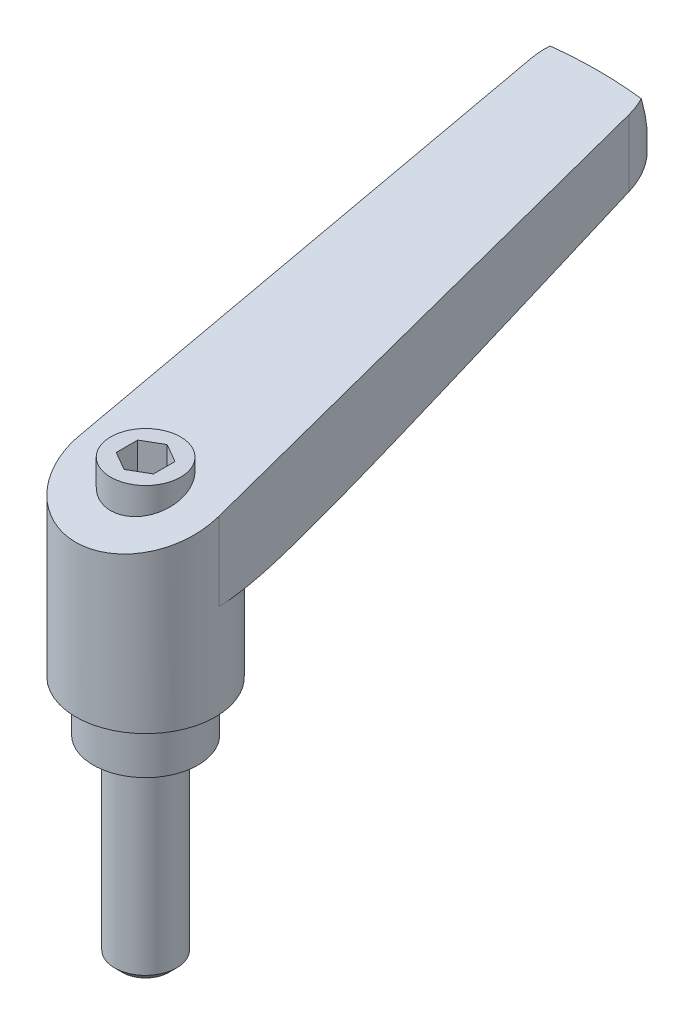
ISO-10303-21;
HEADER;
FILE_DESCRIPTION(('STEP AP214'),'2;1');
FILE_NAME('part.step','',(''),(''),'','','');
FILE_SCHEMA(('AUTOMOTIVE_DESIGN { 1 0 10303 214 1 1 1 1 }'));
ENDSEC;
DATA;
#1=APPLICATION_CONTEXT('core data for automotive mechanical design processes');
#2=APPLICATION_PROTOCOL_DEFINITION('international standard','automotive_design',2000,#1);
#3=PRODUCT_CONTEXT('',#1,'mechanical');
#4=PRODUCT('Part','Part','',(#3));
#5=PRODUCT_RELATED_PRODUCT_CATEGORY('part','',(#4));
#6=PRODUCT_DEFINITION_FORMATION('','',#4);
#7=PRODUCT_DEFINITION_CONTEXT('part definition',#1,'design');
#8=PRODUCT_DEFINITION('design','',#6,#7);
#9=PRODUCT_DEFINITION_SHAPE('','',#8);
#10=(LENGTH_UNIT() NAMED_UNIT(*) SI_UNIT(.MILLI.,.METRE.));
#11=(NAMED_UNIT(*) PLANE_ANGLE_UNIT() SI_UNIT($,.RADIAN.));
#12=(NAMED_UNIT(*) SI_UNIT($,.STERADIAN.) SOLID_ANGLE_UNIT());
#13=UNCERTAINTY_MEASURE_WITH_UNIT(LENGTH_MEASURE(1.E-05),#10,'distance_accuracy_value','');
#14=(GEOMETRIC_REPRESENTATION_CONTEXT(3) GLOBAL_UNCERTAINTY_ASSIGNED_CONTEXT((#13)) GLOBAL_UNIT_ASSIGNED_CONTEXT((#10,
#11,#12)) REPRESENTATION_CONTEXT('',''));
#15=CARTESIAN_POINT('',(0.,0.,0.));
#16=DIRECTION('',(0.,0.,1.));
#17=DIRECTION('',(1.,0.,0.));
#18=AXIS2_PLACEMENT_3D('',#15,#16,#17);
#19=CARTESIAN_POINT('',(0.,0.,0.));
#20=DIRECTION('',(0.,-1.,0.));
#21=DIRECTION('',(0.,0.,-1.));
#22=AXIS2_PLACEMENT_3D('',#19,#20,#21);
#23=PLANE('',#22);
#24=CARTESIAN_POINT('',(0.,0.,0.));
#25=DIRECTION('',(0.,-1.,0.));
#26=DIRECTION('',(0.,0.,-1.));
#27=AXIS2_PLACEMENT_3D('',#24,#25,#26);
#28=CIRCLE('',#27,6.75);
#29=CARTESIAN_POINT('',(0.,0.,-6.75));
#30=VERTEX_POINT('',#29);
#31=EDGE_CURVE('E305',#30,#30,#28,.T.);
#32=ORIENTED_EDGE('',*,*,#31,.T.);
#33=EDGE_LOOP('',(#32));
#34=FACE_BOUND('',#33,.T.);
#35=CARTESIAN_POINT('',(0.,0.,0.));
#36=DIRECTION('',(0.,-1.,0.));
#37=DIRECTION('',(0.,0.,-1.));
#38=AXIS2_PLACEMENT_3D('',#35,#36,#37);
#39=CIRCLE('',#38,4.);
#40=CARTESIAN_POINT('',(0.,0.,-4.));
#41=VERTEX_POINT('',#40);
#42=EDGE_CURVE('E299',#41,#41,#39,.T.);
#43=ORIENTED_EDGE('',*,*,#42,.F.);
#44=EDGE_LOOP('',(#43));
#45=FACE_BOUND('',#44,.T.);
#46=ADVANCED_FACE('F35',(#34,#45),#23,.T.);
#47=CARTESIAN_POINT('',(0.,6.5,0.));
#48=DIRECTION('',(0.,-1.,0.));
#49=DIRECTION('',(0.,0.,-1.));
#50=AXIS2_PLACEMENT_3D('',#47,#48,#49);
#51=PLANE('',#50);
#52=CARTESIAN_POINT('',(0.,6.5,0.));
#53=DIRECTION('',(0.,-1.,0.));
#54=DIRECTION('',(0.,0.,-1.));
#55=AXIS2_PLACEMENT_3D('',#52,#53,#54);
#56=CIRCLE('',#55,9.);
#57=CARTESIAN_POINT('',(0.,6.5,-9.));
#58=VERTEX_POINT('',#57);
#59=EDGE_CURVE('E129',#58,#58,#56,.T.);
#60=ORIENTED_EDGE('',*,*,#59,.T.);
#61=EDGE_LOOP('',(#60));
#62=FACE_BOUND('',#61,.T.);
#63=CARTESIAN_POINT('',(0.,6.5,0.));
#64=DIRECTION('',(0.,-1.,0.));
#65=DIRECTION('',(0.,0.,-1.));
#66=AXIS2_PLACEMENT_3D('',#63,#64,#65);
#67=CIRCLE('',#66,6.75);
#68=CARTESIAN_POINT('',(0.,6.5,-6.75));
#69=VERTEX_POINT('',#68);
#70=EDGE_CURVE('E304',#69,#69,#67,.T.);
#71=ORIENTED_EDGE('',*,*,#70,.F.);
#72=EDGE_LOOP('',(#71));
#73=FACE_BOUND('',#72,.T.);
#74=ADVANCED_FACE('F180',(#62,#73),#51,.T.);
#75=CARTESIAN_POINT('',(0.,12.5193093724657,0.));
#76=DIRECTION('',(0.,1.,0.));
#77=DIRECTION('',(0.,0.,1.));
#78=AXIS2_PLACEMENT_3D('',#75,#76,#77);
#79=CYLINDRICAL_SURFACE('',#78,9.);
#80=DIRECTION('',(0.,1.,0.));
#81=VECTOR('',#80,1.);
#82=CARTESIAN_POINT('',(-8.98942001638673,0.,-0.43626570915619));
#83=LINE('',#82,#81);
#84=CARTESIAN_POINT('',(-8.98942001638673,28.6530006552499,-0.436265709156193));
#85=VERTEX_POINT('',#84);
#86=CARTESIAN_POINT('',(-8.98942001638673,18.5386187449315,-0.436265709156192));
#87=VERTEX_POINT('',#86);
#88=EDGE_CURVE('E96',#85,#87,#83,.F.);
#89=ORIENTED_EDGE('',*,*,#88,.T.);
#90=CARTESIAN_POINT('',(0.,18.5386187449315,0.));
#91=DIRECTION('',(0.,1.,0.));
#92=DIRECTION('',(1.,0.,0.));
#93=AXIS2_PLACEMENT_3D('',#90,#91,#92);
#94=CIRCLE('',#93,9.);
#95=CARTESIAN_POINT('',(8.98942001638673,18.5386187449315,-0.436265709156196));
#96=VERTEX_POINT('',#95);
#97=EDGE_CURVE('E149',#96,#87,#94,.T.);
#98=ORIENTED_EDGE('',*,*,#97,.F.);
#99=DIRECTION('',(0.,1.,0.));
#100=VECTOR('',#99,1.);
#101=CARTESIAN_POINT('',(8.98942001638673,0.,-0.436265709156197));
#102=LINE('',#101,#100);
#103=CARTESIAN_POINT('',(8.98942001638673,28.6530006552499,-0.436265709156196));
#104=VERTEX_POINT('',#103);
#105=EDGE_CURVE('E98',#96,#104,#102,.T.);
#106=ORIENTED_EDGE('',*,*,#105,.T.);
#107=CARTESIAN_POINT('',(0.,28.529641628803,0.));
#108=DIRECTION('',(0.,-0.962270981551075,-0.272092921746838));
#109=DIRECTION('',(0.,0.272092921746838,-0.962270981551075));
#110=AXIS2_PLACEMENT_3D('',#107,#108,#109);
#111=ELLIPSE('',#110,9.35287478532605,9.);
#112=EDGE_CURVE('E91',#104,#85,#111,.T.);
#113=ORIENTED_EDGE('',*,*,#112,.T.);
#114=EDGE_LOOP('',(#89,#98,#106,#113));
#115=FACE_BOUND('',#114,.T.);
#116=ORIENTED_EDGE('',*,*,#59,.F.);
#117=EDGE_LOOP('',(#116));
#118=FACE_BOUND('',#117,.T.);
#119=ADVANCED_FACE('F93',(#115,#118),#79,.T.);
#120=CARTESIAN_POINT('',(0.,37.4621082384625,0.));
#121=DIRECTION('',(0.,1.,0.));
#122=DIRECTION('',(0.,0.,1.));
#123=AXIS2_PLACEMENT_3D('',#120,#121,#122);
#124=CONICAL_SURFACE('',#123,60.9918600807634,1.22173047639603);
#125=CARTESIAN_POINT('',(-6.29259401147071,35.7754430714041,-56.0053859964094));
#126=CARTESIAN_POINT('',(-6.28372206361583,35.841308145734,-56.1884783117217));
#127=CARTESIAN_POINT('',(-6.26682465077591,35.9067660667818,-56.3713355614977));
#128=CARTESIAN_POINT('',(-6.21705617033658,36.0364624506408,-56.7353336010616));
#129=CARTESIAN_POINT('',(-6.18418246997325,36.1007007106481,-56.9164741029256));
#130=CARTESIAN_POINT('',(-6.10244665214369,36.2276782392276,-57.2761492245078));
#131=CARTESIAN_POINT('',(-6.05354749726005,36.2904136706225,-57.4546767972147));
#132=CARTESIAN_POINT('',(-5.93997715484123,36.4138141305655,-57.8073649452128));
#133=CARTESIAN_POINT('',(-5.87530722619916,36.4744793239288,-57.9815258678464));
#134=CARTESIAN_POINT('',(-5.73034210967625,36.5934489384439,-58.3244810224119));
#135=CARTESIAN_POINT('',(-5.65001825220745,36.6517487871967,-58.4932647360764));
#136=CARTESIAN_POINT('',(-5.47422367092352,36.7654639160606,-58.8237650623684));
#137=CARTESIAN_POINT('',(-5.37875353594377,36.8208793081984,-58.9854819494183));
#138=CARTESIAN_POINT('',(-5.17340434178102,36.9283160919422,-59.3001526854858));
#139=CARTESIAN_POINT('',(-5.06355738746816,36.9803446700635,-59.4531249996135));
#140=CARTESIAN_POINT('',(-4.8300042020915,37.0807337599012,-59.7492745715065));
#141=CARTESIAN_POINT('',(-4.70630296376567,37.1290955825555,-59.8924553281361));
#142=CARTESIAN_POINT('',(-4.42575790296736,37.2289271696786,-60.1889211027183));
#143=CARTESIAN_POINT('',(-4.26674035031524,37.2797369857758,-60.3403906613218));
#144=CARTESIAN_POINT('',(-4.01629232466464,37.3515230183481,-60.5550503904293));
#145=CARTESIAN_POINT('',(-3.93079846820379,37.3747191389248,-60.6245296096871));
#146=CARTESIAN_POINT('',(-3.75602881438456,37.4195774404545,-60.7590912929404));
#147=CARTESIAN_POINT('',(-3.66675292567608,37.4412395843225,-60.8241736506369));
#148=CARTESIAN_POINT('',(-3.57567879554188,37.4621082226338,-60.8869568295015));
#149=B_SPLINE_CURVE_WITH_KNOTS('',3,(#125,#126,#127,#128,#129,#130,#131,#132,#133,#134,#135,
#136,#137,#138,#139,#140,#141,#142,#143,#144,#145,#146,#147,#148),.UNSPECIFIED.,.F.,.F.,(4,2,2,
2,2,2,2,2,2,2,2,4),(0.,0.584189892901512,1.1684760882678,1.75412230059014,2.3397217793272,
2.92640401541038,3.51306344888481,4.09843448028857,4.68359523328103,5.35845363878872,
5.69606178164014,6.03367808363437),.UNSPECIFIED.);
#150=CARTESIAN_POINT('',(-6.29259401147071,35.7754430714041,-56.0053859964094));
#151=VERTEX_POINT('',#150);
#152=CARTESIAN_POINT('',(-3.57567876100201,37.4621082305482,-60.8869568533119));
#153=VERTEX_POINT('',#152);
#154=EDGE_CURVE('E135',#151,#153,#149,.T.);
#155=ORIENTED_EDGE('',*,*,#154,.T.);
#156=CARTESIAN_POINT('',(0.,37.4621082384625,0.));
#157=DIRECTION('',(0.,-1.,0.));
#158=DIRECTION('',(1.,0.,0.));
#159=AXIS2_PLACEMENT_3D('',#156,#157,#158);
#160=CIRCLE('',#159,60.9918600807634);
#161=CARTESIAN_POINT('',(3.5756787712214,37.4621082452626,-60.886956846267));
#162=VERTEX_POINT('',#161);
#163=EDGE_CURVE('E145',#162,#153,#160,.F.);
#164=ORIENTED_EDGE('',*,*,#163,.F.);
#165=CARTESIAN_POINT('',(3.57567879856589,37.4621082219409,-60.8869568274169));
#166=CARTESIAN_POINT('',(3.72460383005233,37.4279924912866,-60.7843197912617));
#167=CARTESIAN_POINT('',(3.86873291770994,37.3917361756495,-60.6754786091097));
#168=CARTESIAN_POINT('',(4.14648448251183,37.3152416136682,-60.4464702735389));
#169=CARTESIAN_POINT('',(4.28011023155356,37.2750046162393,-60.3263066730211));
#170=CARTESIAN_POINT('',(4.53565871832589,37.1909498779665,-60.0760384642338));
#171=CARTESIAN_POINT('',(4.6576146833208,37.1471430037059,-59.9459640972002));
#172=CARTESIAN_POINT('',(4.88956351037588,37.0561480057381,-59.6766503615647));
#173=CARTESIAN_POINT('',(4.99955581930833,37.0089597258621,-59.5374105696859));
#174=CARTESIAN_POINT('',(5.20687320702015,36.9115618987,-59.2510132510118));
#175=CARTESIAN_POINT('',(5.3042099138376,36.8613551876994,-59.1038631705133));
#176=CARTESIAN_POINT('',(5.48588312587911,36.7581819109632,-58.8025868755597));
#177=CARTESIAN_POINT('',(5.57021432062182,36.7052142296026,-58.6484578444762));
#178=CARTESIAN_POINT('',(5.72544745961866,36.5968569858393,-58.3343752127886));
#179=CARTESIAN_POINT('',(5.79634820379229,36.5414672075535,-58.1744210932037));
#180=CARTESIAN_POINT('',(5.92442031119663,36.4286047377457,-57.8498178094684));
#181=CARTESIAN_POINT('',(5.98158890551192,36.3711316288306,-57.6851677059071));
#182=CARTESIAN_POINT('',(6.10621739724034,36.2262247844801,-57.2717880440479));
#183=CARTESIAN_POINT('',(6.16532229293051,36.1377215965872,-57.0208406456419));
#184=CARTESIAN_POINT('',(6.23056677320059,36.0030689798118,-56.6415427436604));
#185=CARTESIAN_POINT('',(6.24840828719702,35.9579021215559,-56.5147242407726));
#186=CARTESIAN_POINT('',(6.27632308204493,35.8670410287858,-56.2604499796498));
#187=CARTESIAN_POINT('',(6.28639783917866,35.8213468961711,-56.1329943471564));
#188=CARTESIAN_POINT('',(6.29259401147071,35.7754430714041,-56.0053859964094));
#189=B_SPLINE_CURVE_WITH_KNOTS('',3,(#165,#166,#167,#168,#169,#170,#171,#172,#173,#174,#175,
#176,#177,#178,#179,#180,#181,#182,#183,#184,#185,#186,#187,#188),.UNSPECIFIED.,.F.,.F.,(4,2,2,
2,2,2,2,2,2,2,2,4),(0.,0.551958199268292,1.10374377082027,1.65390833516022,2.20409832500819,
2.75377917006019,3.30368387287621,3.85363768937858,4.40370230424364,5.21931216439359,
5.6265231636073,6.03365674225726),.UNSPECIFIED.);
#190=CARTESIAN_POINT('',(6.29259401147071,35.7754430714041,-56.0053859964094));
#191=VERTEX_POINT('',#190);
#192=EDGE_CURVE('E144',#162,#191,#189,.T.);
#193=ORIENTED_EDGE('',*,*,#192,.T.);
#194=CARTESIAN_POINT('',(6.29259401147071,35.7754430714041,-56.0053859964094));
#195=CARTESIAN_POINT('',(6.34798180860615,35.3648994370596,-54.8640994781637));
#196=CARTESIAN_POINT('',(6.40337447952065,34.9546358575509,-53.7227125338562));
#197=CARTESIAN_POINT('',(6.51417165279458,34.1348013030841,-51.4396948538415));
#198=CARTESIAN_POINT('',(6.56957615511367,33.7252303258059,-50.2980641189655));
#199=CARTESIAN_POINT('',(6.73574949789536,32.4982057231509,-46.8739995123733));
#200=CARTESIAN_POINT('',(6.84653973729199,31.681983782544,-44.5911247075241));
#201=CARTESIAN_POINT('',(7.01269945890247,30.4621694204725,-41.1673407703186));
#202=CARTESIAN_POINT('',(7.06803575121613,30.0566530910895,-40.0271155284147));
#203=CARTESIAN_POINT('',(7.17873608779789,29.247274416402,-37.7460932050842));
#204=CARTESIAN_POINT('',(7.23410013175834,28.8434120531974,-36.6052961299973));
#205=CARTESIAN_POINT('',(7.34489428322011,28.0376184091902,-34.3223407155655));
#206=CARTESIAN_POINT('',(7.4003244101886,27.635688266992,-33.1801819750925));
#207=CARTESIAN_POINT('',(7.51123558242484,26.8346792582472,-30.8948153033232));
#208=CARTESIAN_POINT('',(7.56671662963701,26.4356005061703,-29.7516073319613));
#209=CARTESIAN_POINT('',(7.67793928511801,25.6399993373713,-27.4598224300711));
#210=CARTESIAN_POINT('',(7.73368112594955,25.2434907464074,-26.3112407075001));
#211=CARTESIAN_POINT('',(7.84525056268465,24.4561670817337,-24.0123102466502));
#212=CARTESIAN_POINT('',(7.90107814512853,24.0653511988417,-22.861961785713));
#213=CARTESIAN_POINT('',(7.98487911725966,23.4857617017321,-21.1352110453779));
#214=CARTESIAN_POINT('',(8.01280096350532,23.2938176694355,-20.5598708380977));
#215=CARTESIAN_POINT('',(8.06868696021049,22.9125706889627,-19.4083187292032));
#216=CARTESIAN_POINT('',(8.09665111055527,22.723267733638,-18.8321068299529));
#217=CARTESIAN_POINT('',(8.1526467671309,22.3478833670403,-17.6782951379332));
#218=CARTESIAN_POINT('',(8.18067830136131,22.1618037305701,-17.1006947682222));
#219=CARTESIAN_POINT('',(8.23680745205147,21.7939012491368,-15.9441323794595));
#220=CARTESIAN_POINT('',(8.26490506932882,21.6120784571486,-15.365170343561));
#221=CARTESIAN_POINT('',(8.32133365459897,21.2530199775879,-14.2024379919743));
#222=CARTESIAN_POINT('',(8.34966506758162,21.0758139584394,-13.6186585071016));
#223=CARTESIAN_POINT('',(8.40643403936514,20.7288390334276,-12.4489123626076));
#224=CARTESIAN_POINT('',(8.4348715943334,20.559069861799,-11.8629457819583));
#225=CARTESIAN_POINT('',(8.49183985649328,20.2298122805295,-10.6890931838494));
#226=CARTESIAN_POINT('',(8.52037035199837,20.0703083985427,-10.1012115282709));
#227=CARTESIAN_POINT('',(8.5776092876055,19.7649609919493,-8.92178160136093));
#228=CARTESIAN_POINT('',(8.60631775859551,19.6191199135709,-8.33023269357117));
#229=CARTESIAN_POINT('',(8.66413035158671,19.3454661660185,-7.13898233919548));
#230=CARTESIAN_POINT('',(8.6932358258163,19.2177723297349,-6.53925302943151));
#231=CARTESIAN_POINT('',(8.73706850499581,19.0460035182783,-5.63606408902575));
#232=CARTESIAN_POINT('',(8.75170486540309,18.9920533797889,-5.33447634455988));
#233=CARTESIAN_POINT('',(8.78103956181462,18.891783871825,-4.73002382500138));
#234=CARTESIAN_POINT('',(8.79573789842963,18.8454645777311,-4.42715903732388));
#235=CARTESIAN_POINT('',(8.82527290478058,18.7613046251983,-3.81857905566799));
#236=CARTESIAN_POINT('',(8.84010989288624,18.7235111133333,-3.51285730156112));
#237=CARTESIAN_POINT('',(8.86983456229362,18.6577804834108,-2.90036924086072));
#238=CARTESIAN_POINT('',(8.88472224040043,18.6298427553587,-2.59360300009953));
#239=CARTESIAN_POINT('',(8.91456612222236,18.5846720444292,-1.9786585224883));
#240=CARTESIAN_POINT('',(8.92952240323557,18.5674603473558,-1.67047869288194));
#241=CARTESIAN_POINT('',(8.95197356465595,18.5501873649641,-1.20786401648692));
#242=CARTESIAN_POINT('',(8.95946116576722,18.5458537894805,-1.05357916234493));
#243=CARTESIAN_POINT('',(8.97443912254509,18.5400676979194,-0.744952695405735));
#244=CARTESIAN_POINT('',(8.98192947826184,18.5386152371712,-0.590611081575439));
#245=CARTESIAN_POINT('',(8.98942001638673,18.5386187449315,-0.436265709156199));
#246=B_SPLINE_CURVE_WITH_KNOTS('',3,(#194,#195,#196,#197,#198,#199,#200,#201,#202,#203,#204,
#205,#206,#207,#208,#209,#210,#211,#212,#213,#214,#215,#216,#217,#218,#219,#220,#221,#222,#223,
#224,#225,#226,#227,#228,#229,#230,#231,#232,#233,#234,#235,#236,#237,#238,#239,#240,#241,#242,
#243,#244,#245),.UNSPECIFIED.,.F.,.F.,(4,2,2,2,2,2,2,2,2,2,2,2,2,2,2,2,2,2,2,2,2,2,2,2,2,4),(0.,
3.64243565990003,7.28485909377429,14.5656570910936,18.2000162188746,21.8343359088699,
25.4705843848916,29.106978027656,32.7560921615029,36.4046824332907,38.2261458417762,
40.0476043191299,41.8700357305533,43.6924898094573,45.5246725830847,47.3567898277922,
49.1860776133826,51.0156922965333,52.856784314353,53.7768791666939,54.6969831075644,
55.6220567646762,56.5470731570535,57.473919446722,57.9374775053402,58.4010444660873),.UNSPECIFIED.);
#247=EDGE_CURVE('E139',#191,#96,#246,.T.);
#248=ORIENTED_EDGE('',*,*,#247,.T.);
#249=ORIENTED_EDGE('',*,*,#97,.T.);
#250=CARTESIAN_POINT('',(-8.98942001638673,18.5386187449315,-0.43626570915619));
#251=CARTESIAN_POINT('',(-8.97985861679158,18.538606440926,-0.633281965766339));
#252=CARTESIAN_POINT('',(-8.9702973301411,18.5409786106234,-0.830295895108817));
#253=CARTESIAN_POINT('',(-8.95118062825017,18.5504014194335,-1.2242027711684));
#254=CARTESIAN_POINT('',(-8.94162521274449,18.5574518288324,-1.42109572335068));
#255=CARTESIAN_POINT('',(-8.92253050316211,18.5761352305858,-1.81454943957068));
#256=CARTESIAN_POINT('',(-8.91299120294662,18.587765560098,-2.01111033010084));
#257=CARTESIAN_POINT('',(-8.89392773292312,18.6154367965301,-2.40392034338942));
#258=CARTESIAN_POINT('',(-8.88440356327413,18.6314777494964,-2.6001694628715));
#259=CARTESIAN_POINT('',(-8.85593284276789,18.6857638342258,-3.18681943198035));
#260=CARTESIAN_POINT('',(-8.83701368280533,18.7302481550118,-3.57665588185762));
#261=CARTESIAN_POINT('',(-8.79926857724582,18.8338119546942,-4.35440806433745));
#262=CARTESIAN_POINT('',(-8.78044264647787,18.8928936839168,-4.74232349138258));
#263=CARTESIAN_POINT('',(-8.74298417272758,19.023054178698,-5.51416951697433));
#264=CARTESIAN_POINT('',(-8.72435113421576,19.0940728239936,-5.89811032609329));
#265=CARTESIAN_POINT('',(-8.68718364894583,19.2461944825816,-6.6639604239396));
#266=CARTESIAN_POINT('',(-8.66864919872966,19.3272971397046,-7.0458697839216));
#267=CARTESIAN_POINT('',(-8.63164797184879,19.4978472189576,-7.80829406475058));
#268=CARTESIAN_POINT('',(-8.61318130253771,19.5873044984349,-8.18880677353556));
#269=CARTESIAN_POINT('',(-8.58554157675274,19.7265349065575,-8.75833378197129));
#270=CARTESIAN_POINT('',(-8.57633837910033,19.7737858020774,-8.94796915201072));
#271=CARTESIAN_POINT('',(-8.55795065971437,19.8698091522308,-9.32685506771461));
#272=CARTESIAN_POINT('',(-8.54876613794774,19.9185816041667,-9.51610561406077));
#273=CARTESIAN_POINT('',(-8.52147216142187,20.0656944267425,-10.0785083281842));
#274=CARTESIAN_POINT('',(-8.50338782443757,20.1660200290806,-10.4511429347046));
#275=CARTESIAN_POINT('',(-8.46727730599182,20.37104043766,-11.1952138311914));
#276=CARTESIAN_POINT('',(-8.44925112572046,20.4757353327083,-11.5666500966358));
#277=CARTESIAN_POINT('',(-8.41324759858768,20.6887293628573,-12.3085163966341));
#278=CARTESIAN_POINT('',(-8.39527025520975,20.7970287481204,-12.6789463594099));
#279=CARTESIAN_POINT('',(-8.35935841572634,21.016613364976,-13.4189234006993));
#280=CARTESIAN_POINT('',(-8.34142391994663,21.1278986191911,-13.7884704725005));
#281=CARTESIAN_POINT('',(-8.28766562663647,21.465527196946,-14.896180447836));
#282=CARTESIAN_POINT('',(-8.25189666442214,21.6955856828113,-15.6332134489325));
#283=CARTESIAN_POINT('',(-8.18046838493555,22.1627037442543,-17.1050201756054));
#284=CARTESIAN_POINT('',(-8.14480906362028,22.3997630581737,-17.8397939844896));
#285=CARTESIAN_POINT('',(-8.07356395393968,22.8790726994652,-19.3078264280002));
#286=CARTESIAN_POINT('',(-8.03797818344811,23.1213241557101,-20.0410846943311));
#287=CARTESIAN_POINT('',(-7.96686859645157,23.6096790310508,-21.5063246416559));
#288=CARTESIAN_POINT('',(-7.93134478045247,23.8557824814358,-22.2383063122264));
#289=CARTESIAN_POINT('',(-7.86035135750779,24.3508973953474,-23.7011526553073));
#290=CARTESIAN_POINT('',(-7.82488174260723,24.5999083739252,-24.4320174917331));
#291=CARTESIAN_POINT('',(-7.75398075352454,25.1002377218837,-25.8929592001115));
#292=CARTESIAN_POINT('',(-7.71854937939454,25.3515560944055,-26.6230360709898));
#293=CARTESIAN_POINT('',(-7.61185777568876,26.1113869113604,-28.8214569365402));
#294=CARTESIAN_POINT('',(-7.54064384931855,26.6226654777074,-30.2888468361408));
#295=CARTESIAN_POINT('',(-7.39829463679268,27.6500397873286,-33.2220062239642));
#296=CARTESIAN_POINT('',(-7.32715935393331,28.1661357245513,-34.6877756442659));
#297=CARTESIAN_POINT('',(-7.18496317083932,29.2015363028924,-37.6177818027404));
#298=CARTESIAN_POINT('',(-7.11390225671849,29.7208401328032,-39.082018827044));
#299=CARTESIAN_POINT('',(-6.97182234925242,30.7618348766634,-42.0096290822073));
#300=CARTESIAN_POINT('',(-6.90080335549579,31.2835257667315,-43.4730023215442));
#301=CARTESIAN_POINT('',(-6.78494036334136,32.136268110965,-45.8604031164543));
#302=CARTESIAN_POINT('',(-6.74008711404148,32.466784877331,-46.7846212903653));
#303=CARTESIAN_POINT('',(-6.65038901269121,33.1284323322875,-48.6328846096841));
#304=CARTESIAN_POINT('',(-6.60554416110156,33.4595630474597,-49.5569297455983));
#305=CARTESIAN_POINT('',(-6.51600982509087,34.1212474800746,-51.4018186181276));
#306=CARTESIAN_POINT('',(-6.47132031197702,34.4517995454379,-52.322662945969));
#307=CARTESIAN_POINT('',(-6.38195081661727,35.1133216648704,-54.1641552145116));
#308=CARTESIAN_POINT('',(-6.33727083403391,35.4442916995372,-55.0848031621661));
#309=CARTESIAN_POINT('',(-6.29259401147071,35.7754430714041,-56.0053859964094));
#310=B_SPLINE_CURVE_WITH_KNOTS('',3,(#250,#251,#252,#253,#254,#255,#256,#257,#258,#259,#260,
#261,#262,#263,#264,#265,#266,#267,#268,#269,#270,#271,#272,#273,#274,#275,#276,#277,#278,#279,
#280,#281,#282,#283,#284,#285,#286,#287,#288,#289,#290,#291,#292,#293,#294,#295,#296,#297,#298,
#299,#300,#301,#302,#303,#304,#305,#306,#307,#308,#309),.UNSPECIFIED.,.F.,.F.,(4,2,2,2,2,2,2,2,
2,2,2,2,2,2,2,2,2,2,2,2,2,2,2,2,2,2,2,2,2,4),(0.,0.591726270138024,1.18342348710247,
1.77477718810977,2.36613706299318,3.54425078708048,4.72254624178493,5.89507589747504,
7.06756415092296,8.24145369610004,8.82839873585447,9.4153427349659,10.5742886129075,
11.7332580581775,12.892308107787,14.0513669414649,16.3701058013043,18.6887581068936,
21.007919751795,23.3271002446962,25.6458992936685,27.9647014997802,32.6313119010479,
37.2981109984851,41.9637746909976,46.6293918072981,49.5770841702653,52.524907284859,
55.4630945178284,58.4011500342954),.UNSPECIFIED.);
#311=EDGE_CURVE('E112',#87,#151,#310,.T.);
#312=ORIENTED_EDGE('',*,*,#311,.T.);
#313=EDGE_LOOP('',(#155,#164,#193,#248,#249,#312));
#314=FACE_BOUND('',#313,.T.);
#315=ADVANCED_FACE('F315',(#314),#124,.T.);
#316=CARTESIAN_POINT('',(0.,35.7205521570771,-55.7));
#317=DIRECTION('',(0.,1.,0.));
#318=DIRECTION('',(0.,0.,1.));
#319=AXIS2_PLACEMENT_3D('',#316,#317,#318);
#320=CYLINDRICAL_SURFACE('',#319,6.3);
#321=DIRECTION('',(0.,1.,0.));
#322=VECTOR('',#321,1.);
#323=CARTESIAN_POINT('',(6.29259401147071,0.,-56.0053859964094));
#324=LINE('',#323,#322);
#325=CARTESIAN_POINT('',(6.29259401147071,44.3657931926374,-56.0053859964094));
#326=VERTEX_POINT('',#325);
#327=EDGE_CURVE('E140',#326,#191,#324,.F.);
#328=ORIENTED_EDGE('',*,*,#327,.T.);
#329=ORIENTED_EDGE('',*,*,#192,.F.);
#330=CARTESIAN_POINT('',(5.87324142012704,44.9239287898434,-57.9792620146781));
#331=CARTESIAN_POINT('',(5.82535509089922,44.6001356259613,-58.1025627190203));
#332=CARTESIAN_POINT('',(5.7730240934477,44.2770144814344,-58.225982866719));
#333=CARTESIAN_POINT('',(5.65859186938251,43.6325054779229,-58.4728997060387));
#334=CARTESIAN_POINT('',(5.59648972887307,43.311117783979,-58.5963964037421));
#335=CARTESIAN_POINT('',(5.46211230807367,42.6727553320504,-58.8424215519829));
#336=CARTESIAN_POINT('',(5.38991085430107,42.3557654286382,-58.9649507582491));
#337=CARTESIAN_POINT('',(5.23386884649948,41.7245298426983,-59.2096566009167));
#338=CARTESIAN_POINT('',(5.15002898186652,41.4102839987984,-59.3318332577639));
#339=CARTESIAN_POINT('',(4.96912232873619,40.7848764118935,-59.5756814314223));
#340=CARTESIAN_POINT('',(4.87203770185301,40.4737194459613,-59.6973520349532));
#341=CARTESIAN_POINT('',(4.66283934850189,39.8561270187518,-59.9395235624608));
#342=CARTESIAN_POINT('',(4.55073180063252,39.5496896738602,-60.0600249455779));
#343=CARTESIAN_POINT('',(4.36890604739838,39.0937105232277,-60.2398201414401));
#344=CARTESIAN_POINT('',(4.30577334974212,38.9418019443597,-60.2998018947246));
#345=CARTESIAN_POINT('',(4.1745988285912,38.6398951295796,-60.419172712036));
#346=CARTESIAN_POINT('',(4.10655749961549,38.4898967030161,-60.4785618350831));
#347=CARTESIAN_POINT('',(3.96497409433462,38.1919547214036,-60.5966837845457));
#348=CARTESIAN_POINT('',(3.8914245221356,38.0440143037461,-60.6554155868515));
#349=CARTESIAN_POINT('',(3.73825635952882,37.7508674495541,-60.7719454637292));
#350=CARTESIAN_POINT('',(3.65863569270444,37.6056619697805,-60.8297432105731));
#351=CARTESIAN_POINT('',(3.5756787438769,37.4621082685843,-60.8869568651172));
#352=B_SPLINE_CURVE_WITH_KNOTS('',3,(#330,#331,#332,#333,#334,#335,#336,#337,#338,#339,#340,
#341,#342,#343,#344,#345,#346,#347,#348,#349,#350,#351),.UNSPECIFIED.,.F.,.F.,(4,2,2,2,2,2,2,2,
2,2,4),(0.,1.04931969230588,2.09873758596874,3.14085028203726,4.18290127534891,5.2263698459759,
6.26941057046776,6.79464312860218,7.31982284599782,7.84573071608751,8.3718192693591),.UNSPECIFIED.);
#353=CARTESIAN_POINT('',(5.87324141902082,44.9239287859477,-57.9792619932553));
#354=VERTEX_POINT('',#353);
#355=EDGE_CURVE('E148',#354,#162,#352,.T.);
#356=ORIENTED_EDGE('',*,*,#355,.F.);
#357=CARTESIAN_POINT('',(0.,44.2794418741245,-55.7));
#358=DIRECTION('',(0.,-0.962270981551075,-0.272092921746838));
#359=DIRECTION('',(0.,0.272092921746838,-0.962270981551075));
#360=AXIS2_PLACEMENT_3D('',#357,#358,#359);
#361=ELLIPSE('',#360,6.54701234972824,6.3);
#362=EDGE_CURVE('E133',#354,#326,#361,.T.);
#363=ORIENTED_EDGE('',*,*,#362,.T.);
#364=EDGE_LOOP('',(#328,#329,#356,#363));
#365=FACE_BOUND('',#364,.T.);
#366=ADVANCED_FACE('F320',(#365),#320,.T.);
#367=CARTESIAN_POINT('',(8.98942001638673,0.,-0.436265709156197));
#368=DIRECTION('',(-0.998824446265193,0.,0.0484739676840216));
#369=DIRECTION('',(0.0484739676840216,0.,0.998824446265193));
#370=AXIS2_PLACEMENT_3D('',#367,#368,#369);
#371=PLANE('',#370);
#372=ORIENTED_EDGE('',*,*,#105,.F.);
#373=ORIENTED_EDGE('',*,*,#247,.F.);
#374=ORIENTED_EDGE('',*,*,#327,.F.);
#375=DIRECTION('',(0.046649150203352,-0.271796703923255,0.961223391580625));
#376=VECTOR('',#375,1.);
#377=CARTESIAN_POINT('',(6.29259401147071,44.3657931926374,-56.0053859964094));
#378=LINE('',#377,#376);
#379=EDGE_CURVE('E105',#326,#104,#378,.T.);
#380=ORIENTED_EDGE('',*,*,#379,.T.);
#381=EDGE_LOOP('',(#372,#373,#374,#380));
#382=FACE_BOUND('',#381,.T.);
#383=ADVANCED_FACE('F324',(#382),#371,.F.);
#384=CARTESIAN_POINT('',(-6.29259401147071,0.,-56.0053859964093));
#385=DIRECTION('',(0.998824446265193,0.,0.0484739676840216));
#386=DIRECTION('',(0.0484739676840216,0.,-0.998824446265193));
#387=AXIS2_PLACEMENT_3D('',#384,#385,#386);
#388=PLANE('',#387);
#389=DIRECTION('',(0.,1.,0.));
#390=VECTOR('',#389,1.);
#391=CARTESIAN_POINT('',(-6.29259401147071,0.,-56.0053859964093));
#392=LINE('',#391,#390);
#393=CARTESIAN_POINT('',(-6.29259401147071,44.3657931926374,-56.0053859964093));
#394=VERTEX_POINT('',#393);
#395=EDGE_CURVE('E134',#394,#151,#392,.F.);
#396=ORIENTED_EDGE('',*,*,#395,.T.);
#397=ORIENTED_EDGE('',*,*,#311,.F.);
#398=ORIENTED_EDGE('',*,*,#88,.F.);
#399=DIRECTION('',(0.0466491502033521,0.271796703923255,-0.961223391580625));
#400=VECTOR('',#399,1.);
#401=CARTESIAN_POINT('',(-8.98942001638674,28.6530006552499,-0.436265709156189));
#402=LINE('',#401,#400);
#403=EDGE_CURVE('E104',#85,#394,#402,.T.);
#404=ORIENTED_EDGE('',*,*,#403,.T.);
#405=EDGE_LOOP('',(#396,#397,#398,#404));
#406=FACE_BOUND('',#405,.T.);
#407=ADVANCED_FACE('F111',(#406),#388,.F.);
#408=CARTESIAN_POINT('',(0.,35.7205521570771,-55.7));
#409=DIRECTION('',(0.,1.,0.));
#410=DIRECTION('',(0.,0.,1.));
#411=AXIS2_PLACEMENT_3D('',#408,#409,#410);
#412=CYLINDRICAL_SURFACE('',#411,6.3);
#413=CARTESIAN_POINT('',(-3.57567874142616,37.4621082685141,-60.8869568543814));
#414=CARTESIAN_POINT('',(-3.63175980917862,37.5591226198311,-60.8482917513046));
#415=CARTESIAN_POINT('',(-3.68630366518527,37.6569028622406,-60.8093551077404));
#416=CARTESIAN_POINT('',(-3.79252427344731,37.8538071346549,-60.7310163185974));
#417=CARTESIAN_POINT('',(-3.84420141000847,37.9529309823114,-60.6916142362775));
#418=CARTESIAN_POINT('',(-3.99519672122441,38.2519391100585,-60.5728646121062));
#419=CARTESIAN_POINT('',(-4.09055488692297,38.4535931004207,-60.4929206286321));
#420=CARTESIAN_POINT('',(-4.2718386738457,38.8600913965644,-60.3320660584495));
#421=CARTESIAN_POINT('',(-4.3577842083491,39.0649278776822,-60.2511579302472));
#422=CARTESIAN_POINT('',(-4.52155508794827,39.4775278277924,-60.0884915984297));
#423=CARTESIAN_POINT('',(-4.59937889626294,39.6852918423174,-60.0067332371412));
#424=CARTESIAN_POINT('',(-4.74711642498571,40.1014063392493,-59.8432978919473));
#425=CARTESIAN_POINT('',(-4.8170910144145,40.3097372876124,-59.7616259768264));
#426=CARTESIAN_POINT('',(-4.95054747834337,40.7283056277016,-59.5978487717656));
#427=CARTESIAN_POINT('',(-5.01402887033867,40.9385431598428,-59.5157434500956));
#428=CARTESIAN_POINT('',(-5.19564518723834,41.5718103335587,-59.2689090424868));
#429=CARTESIAN_POINT('',(-5.30489735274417,41.9972368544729,-59.103723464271));
#430=CARTESIAN_POINT('',(-5.45176075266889,42.6309877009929,-58.8586222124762));
#431=CARTESIAN_POINT('',(-5.49716856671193,42.837627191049,-58.7788567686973));
#432=CARTESIAN_POINT('',(-5.58353901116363,43.2517599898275,-58.6193029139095));
#433=CARTESIAN_POINT('',(-5.62450293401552,43.4592530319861,-58.5395145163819));
#434=CARTESIAN_POINT('',(-5.70241573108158,43.8758546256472,-58.379626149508));
#435=CARTESIAN_POINT('',(-5.73934778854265,44.0849663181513,-58.2995262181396));
#436=CARTESIAN_POINT('',(-5.80923067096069,44.5039304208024,-58.1393561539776));
#437=CARTESIAN_POINT('',(-5.84218044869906,44.7137830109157,-58.0592860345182));
#438=CARTESIAN_POINT('',(-5.87324141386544,44.923928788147,-57.9792620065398));
#439=B_SPLINE_CURVE_WITH_KNOTS('',3,(#413,#414,#415,#416,#417,#418,#419,#420,#421,#422,#423,
#424,#425,#426,#427,#428,#429,#430,#431,#432,#433,#434,#435,#436,#437,#438),.UNSPECIFIED.,.F.,
.F.,(4,2,2,2,2,2,2,2,2,2,2,2,4),(0.,0.355589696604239,0.711131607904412,1.4217292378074,
2.13079324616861,2.83999118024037,3.54324092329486,4.24654288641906,5.65368043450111,
6.33197341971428,7.01006860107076,7.69089195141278,8.37189394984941),.UNSPECIFIED.);
#440=CARTESIAN_POINT('',(-5.87324141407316,44.9239287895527,-57.9792620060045));
#441=VERTEX_POINT('',#440);
#442=EDGE_CURVE('E59',#153,#441,#439,.T.);
#443=ORIENTED_EDGE('',*,*,#442,.F.);
#444=ORIENTED_EDGE('',*,*,#154,.F.);
#445=ORIENTED_EDGE('',*,*,#395,.F.);
#446=CARTESIAN_POINT('',(0.,44.2794418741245,-55.7));
#447=DIRECTION('',(0.,-0.962270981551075,-0.272092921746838));
#448=DIRECTION('',(0.,0.272092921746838,-0.962270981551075));
#449=AXIS2_PLACEMENT_3D('',#446,#447,#448);
#450=ELLIPSE('',#449,6.54701234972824,6.3);
#451=EDGE_CURVE('E118',#394,#441,#450,.T.);
#452=ORIENTED_EDGE('',*,*,#451,.T.);
#453=EDGE_LOOP('',(#443,#444,#445,#452));
#454=FACE_BOUND('',#453,.T.);
#455=ADVANCED_FACE('F168',(#454),#412,.T.);
#456=CARTESIAN_POINT('',(0.,37.4621082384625,0.));
#457=DIRECTION('',(0.,-1.,0.));
#458=DIRECTION('',(0.,0.,-1.));
#459=AXIS2_PLACEMENT_3D('',#456,#457,#458);
#460=CONICAL_SURFACE('',#459,60.9918600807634,0.349065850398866);
#461=ORIENTED_EDGE('',*,*,#163,.T.);
#462=ORIENTED_EDGE('',*,*,#442,.T.);
#463=CARTESIAN_POINT('',(0.,26.6401020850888,6.6824563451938));
#464=DIRECTION('',(0.,-0.962270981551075,-0.272092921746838));
#465=DIRECTION('',(0.,-0.272092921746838,0.962270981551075));
#466=AXIS2_PLACEMENT_3D('',#463,#464,#465);
#467=ELLIPSE('',#466,67.4765730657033,64.5859647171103);
#468=EDGE_CURVE('E125',#441,#354,#467,.T.);
#469=ORIENTED_EDGE('',*,*,#468,.T.);
#470=ORIENTED_EDGE('',*,*,#355,.T.);
#471=EDGE_LOOP('',(#461,#462,#469,#470));
#472=FACE_BOUND('',#471,.T.);
#473=ADVANCED_FACE('F171',(#472),#460,.T.);
#474=CARTESIAN_POINT('',(18.,25.9847906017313,9.));
#475=DIRECTION('',(0.,-0.962270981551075,-0.272092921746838));
#476=DIRECTION('',(0.,0.272092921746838,-0.962270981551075));
#477=AXIS2_PLACEMENT_3D('',#474,#475,#476);
#478=PLANE('',#477);
#479=CARTESIAN_POINT('',(0.,28.5296416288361,0.));
#480=DIRECTION('',(0.,-0.962270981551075,-0.272092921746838));
#481=DIRECTION('',(0.,0.272092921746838,-0.962270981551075));
#482=AXIS2_PLACEMENT_3D('',#479,#480,#481);
#483=ELLIPSE('',#482,4.67643739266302,4.5);
#484=CARTESIAN_POINT('',(0.,29.8020671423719,-4.5));
#485=VERTEX_POINT('',#484);
#486=EDGE_CURVE('E282',#485,#485,#483,.F.);
#487=ORIENTED_EDGE('',*,*,#486,.F.);
#488=EDGE_LOOP('',(#487));
#489=FACE_BOUND('',#488,.T.);
#490=ORIENTED_EDGE('',*,*,#451,.F.);
#491=ORIENTED_EDGE('',*,*,#403,.F.);
#492=ORIENTED_EDGE('',*,*,#112,.F.);
#493=ORIENTED_EDGE('',*,*,#379,.F.);
#494=ORIENTED_EDGE('',*,*,#362,.F.);
#495=ORIENTED_EDGE('',*,*,#468,.F.);
#496=EDGE_LOOP('',(#490,#491,#492,#493,#494,#495));
#497=FACE_BOUND('',#496,.T.);
#498=ADVANCED_FACE('F116',(#489,#497),#478,.F.);
#499=CARTESIAN_POINT('',(0.,0.,0.));
#500=DIRECTION('',(0.,1.,0.));
#501=DIRECTION('',(0.,0.,1.));
#502=AXIS2_PLACEMENT_3D('',#499,#500,#501);
#503=CYLINDRICAL_SURFACE('',#502,6.75);
#504=ORIENTED_EDGE('',*,*,#31,.F.);
#505=EDGE_LOOP('',(#504));
#506=FACE_BOUND('',#505,.T.);
#507=ORIENTED_EDGE('',*,*,#70,.T.);
#508=EDGE_LOOP('',(#507));
#509=FACE_BOUND('',#508,.T.);
#510=ADVANCED_FACE('F178',(#506,#509),#503,.T.);
#511=CARTESIAN_POINT('',(0.,-25.,0.));
#512=DIRECTION('',(0.,1.,0.));
#513=DIRECTION('',(0.,0.,1.));
#514=AXIS2_PLACEMENT_3D('',#511,#512,#513);
#515=CYLINDRICAL_SURFACE('',#514,4.);
#516=CARTESIAN_POINT('',(0.,-23.9999999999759,0.));
#517=DIRECTION('',(0.,-1.,0.));
#518=DIRECTION('',(0.,0.,-1.));
#519=AXIS2_PLACEMENT_3D('',#516,#517,#518);
#520=CIRCLE('',#519,4.);
#521=CARTESIAN_POINT('',(0.,-23.9999999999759,-4.));
#522=VERTEX_POINT('',#521);
#523=EDGE_CURVE('E12',#522,#522,#520,.F.);
#524=ORIENTED_EDGE('',*,*,#523,.T.);
#525=EDGE_LOOP('',(#524));
#526=FACE_BOUND('',#525,.T.);
#527=ORIENTED_EDGE('',*,*,#42,.T.);
#528=EDGE_LOOP('',(#527));
#529=FACE_BOUND('',#528,.T.);
#530=ADVANCED_FACE('F186',(#526,#529),#515,.T.);
#531=CARTESIAN_POINT('',(0.,-25.,0.));
#532=DIRECTION('',(0.,-1.,0.));
#533=DIRECTION('',(0.,0.,-1.));
#534=AXIS2_PLACEMENT_3D('',#531,#532,#533);
#535=PLANE('',#534);
#536=CARTESIAN_POINT('',(0.,-25.,0.));
#537=DIRECTION('',(0.,-1.,0.));
#538=DIRECTION('',(0.,0.,-1.));
#539=AXIS2_PLACEMENT_3D('',#536,#537,#538);
#540=CIRCLE('',#539,3.00000000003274);
#541=CARTESIAN_POINT('',(0.,-25.,-3.00000000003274));
#542=VERTEX_POINT('',#541);
#543=EDGE_CURVE('E43',#542,#542,#540,.T.);
#544=ORIENTED_EDGE('',*,*,#543,.T.);
#545=EDGE_LOOP('',(#544));
#546=FACE_BOUND('',#545,.T.);
#547=ADVANCED_FACE('F193',(#546),#535,.T.);
#548=CARTESIAN_POINT('',(0.,-500000.,0.));
#549=DIRECTION('',(0.,1.,0.));
#550=DIRECTION('',(0.,0.,1.));
#551=AXIS2_PLACEMENT_3D('',#548,#549,#550);
#552=CYLINDRICAL_SURFACE('',#551,4.5);
#553=CARTESIAN_POINT('',(0.,31.,0.));
#554=DIRECTION('',(0.,1.,0.));
#555=DIRECTION('',(0.,0.,-1.));
#556=AXIS2_PLACEMENT_3D('',#553,#554,#555);
#557=CIRCLE('',#556,4.5);
#558=CARTESIAN_POINT('',(0.,31.,-4.5));
#559=VERTEX_POINT('',#558);
#560=EDGE_CURVE('E296',#559,#559,#557,.T.);
#561=ORIENTED_EDGE('',*,*,#560,.F.);
#562=EDGE_LOOP('',(#561));
#563=FACE_BOUND('',#562,.T.);
#564=ORIENTED_EDGE('',*,*,#486,.T.);
#565=EDGE_LOOP('',(#564));
#566=FACE_BOUND('',#565,.T.);
#567=ADVANCED_FACE('F197',(#563,#566),#552,.T.);
#568=CARTESIAN_POINT('',(0.,31.,0.));
#569=DIRECTION('',(0.,-1.,0.));
#570=DIRECTION('',(0.,0.,-1.));
#571=AXIS2_PLACEMENT_3D('',#568,#569,#570);
#572=PLANE('',#571);
#573=DIRECTION('',(-0.866025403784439,0.,-0.5));
#574=VECTOR('',#573,1.);
#575=CARTESIAN_POINT('',(2.4,31.,-1.3856406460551));
#576=LINE('',#575,#574);
#577=CARTESIAN_POINT('',(2.4,31.,-1.3856406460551));
#578=VERTEX_POINT('',#577);
#579=CARTESIAN_POINT('',(0.,31.,-2.7712812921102));
#580=VERTEX_POINT('',#579);
#581=EDGE_CURVE('E269',#578,#580,#576,.T.);
#582=ORIENTED_EDGE('',*,*,#581,.F.);
#583=DIRECTION('',(0.,0.,-1.));
#584=VECTOR('',#583,1.);
#585=CARTESIAN_POINT('',(2.4,31.,1.3856406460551));
#586=LINE('',#585,#584);
#587=CARTESIAN_POINT('',(2.4,31.,1.3856406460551));
#588=VERTEX_POINT('',#587);
#589=EDGE_CURVE('E50',#588,#578,#586,.T.);
#590=ORIENTED_EDGE('',*,*,#589,.F.);
#591=DIRECTION('',(0.866025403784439,0.,-0.5));
#592=VECTOR('',#591,1.);
#593=CARTESIAN_POINT('',(0.,31.,2.7712812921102));
#594=LINE('',#593,#592);
#595=CARTESIAN_POINT('',(0.,31.,2.7712812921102));
#596=VERTEX_POINT('',#595);
#597=EDGE_CURVE('E252',#596,#588,#594,.T.);
#598=ORIENTED_EDGE('',*,*,#597,.F.);
#599=DIRECTION('',(0.866025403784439,0.,0.5));
#600=VECTOR('',#599,1.);
#601=CARTESIAN_POINT('',(-2.4,31.,1.3856406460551));
#602=LINE('',#601,#600);
#603=CARTESIAN_POINT('',(-2.4,31.,1.3856406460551));
#604=VERTEX_POINT('',#603);
#605=EDGE_CURVE('E257',#604,#596,#602,.T.);
#606=ORIENTED_EDGE('',*,*,#605,.F.);
#607=DIRECTION('',(0.,0.,1.));
#608=VECTOR('',#607,1.);
#609=CARTESIAN_POINT('',(-2.4,31.,-1.3856406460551));
#610=LINE('',#609,#608);
#611=CARTESIAN_POINT('',(-2.4,31.,-1.3856406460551));
#612=VERTEX_POINT('',#611);
#613=EDGE_CURVE('E275',#612,#604,#610,.T.);
#614=ORIENTED_EDGE('',*,*,#613,.F.);
#615=DIRECTION('',(-0.866025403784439,0.,0.5));
#616=VECTOR('',#615,1.);
#617=CARTESIAN_POINT('',(0.,31.,-2.7712812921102));
#618=LINE('',#617,#616);
#619=EDGE_CURVE('E272',#580,#612,#618,.T.);
#620=ORIENTED_EDGE('',*,*,#619,.F.);
#621=EDGE_LOOP('',(#582,#590,#598,#606,#614,#620));
#622=FACE_BOUND('',#621,.T.);
#623=ORIENTED_EDGE('',*,*,#560,.T.);
#624=EDGE_LOOP('',(#623));
#625=FACE_BOUND('',#624,.T.);
#626=ADVANCED_FACE('F199',(#622,#625),#572,.F.);
#627=CARTESIAN_POINT('',(2.4,26.2,1.3856406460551));
#628=DIRECTION('',(1.,0.,0.));
#629=DIRECTION('',(0.,0.,-1.));
#630=AXIS2_PLACEMENT_3D('',#627,#628,#629);
#631=PLANE('',#630);
#632=ORIENTED_EDGE('',*,*,#589,.T.);
#633=DIRECTION('',(0.,1.,0.));
#634=VECTOR('',#633,1.);
#635=CARTESIAN_POINT('',(2.4,26.2,-1.3856406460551));
#636=LINE('',#635,#634);
#637=CARTESIAN_POINT('',(2.4,26.2,-1.3856406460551));
#638=VERTEX_POINT('',#637);
#639=EDGE_CURVE('E267',#638,#578,#636,.T.);
#640=ORIENTED_EDGE('',*,*,#639,.F.);
#641=DIRECTION('',(0.,0.,-1.));
#642=VECTOR('',#641,1.);
#643=CARTESIAN_POINT('',(2.4,26.2,1.3856406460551));
#644=LINE('',#643,#642);
#645=CARTESIAN_POINT('',(2.4,26.2,1.3856406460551));
#646=VERTEX_POINT('',#645);
#647=EDGE_CURVE('E241',#646,#638,#644,.T.);
#648=ORIENTED_EDGE('',*,*,#647,.F.);
#649=DIRECTION('',(0.,1.,0.));
#650=VECTOR('',#649,1.);
#651=CARTESIAN_POINT('',(2.4,26.2,1.3856406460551));
#652=LINE('',#651,#650);
#653=EDGE_CURVE('E280',#646,#588,#652,.T.);
#654=ORIENTED_EDGE('',*,*,#653,.T.);
#655=EDGE_LOOP('',(#632,#640,#648,#654));
#656=FACE_BOUND('',#655,.T.);
#657=ADVANCED_FACE('F203',(#656),#631,.F.);
#658=CARTESIAN_POINT('',(0.,26.2,2.7712812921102));
#659=DIRECTION('',(0.5,0.,0.866025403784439));
#660=DIRECTION('',(0.866025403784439,0.,-0.5));
#661=AXIS2_PLACEMENT_3D('',#658,#659,#660);
#662=PLANE('',#661);
#663=ORIENTED_EDGE('',*,*,#597,.T.);
#664=ORIENTED_EDGE('',*,*,#653,.F.);
#665=DIRECTION('',(0.866025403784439,0.,-0.5));
#666=VECTOR('',#665,1.);
#667=CARTESIAN_POINT('',(0.,26.2,2.7712812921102));
#668=LINE('',#667,#666);
#669=CARTESIAN_POINT('',(0.,26.2,2.7712812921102));
#670=VERTEX_POINT('',#669);
#671=EDGE_CURVE('E249',#670,#646,#668,.T.);
#672=ORIENTED_EDGE('',*,*,#671,.F.);
#673=DIRECTION('',(0.,1.,0.));
#674=VECTOR('',#673,1.);
#675=CARTESIAN_POINT('',(0.,26.2,2.7712812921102));
#676=LINE('',#675,#674);
#677=EDGE_CURVE('E283',#670,#596,#676,.T.);
#678=ORIENTED_EDGE('',*,*,#677,.T.);
#679=EDGE_LOOP('',(#663,#664,#672,#678));
#680=FACE_BOUND('',#679,.T.);
#681=ADVANCED_FACE('F209',(#680),#662,.F.);
#682=CARTESIAN_POINT('',(-2.4,26.2,1.3856406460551));
#683=DIRECTION('',(-0.5,0.,0.866025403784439));
#684=DIRECTION('',(0.866025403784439,0.,0.5));
#685=AXIS2_PLACEMENT_3D('',#682,#683,#684);
#686=PLANE('',#685);
#687=ORIENTED_EDGE('',*,*,#605,.T.);
#688=ORIENTED_EDGE('',*,*,#677,.F.);
#689=DIRECTION('',(0.866025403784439,0.,0.5));
#690=VECTOR('',#689,1.);
#691=CARTESIAN_POINT('',(-2.4,26.2,1.3856406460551));
#692=LINE('',#691,#690);
#693=CARTESIAN_POINT('',(-2.4,26.2,1.3856406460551));
#694=VERTEX_POINT('',#693);
#695=EDGE_CURVE('E264',#694,#670,#692,.T.);
#696=ORIENTED_EDGE('',*,*,#695,.F.);
#697=DIRECTION('',(0.,1.,0.));
#698=VECTOR('',#697,1.);
#699=CARTESIAN_POINT('',(-2.4,26.2,1.3856406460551));
#700=LINE('',#699,#698);
#701=EDGE_CURVE('E286',#694,#604,#700,.T.);
#702=ORIENTED_EDGE('',*,*,#701,.T.);
#703=EDGE_LOOP('',(#687,#688,#696,#702));
#704=FACE_BOUND('',#703,.T.);
#705=ADVANCED_FACE('F222',(#704),#686,.F.);
#706=CARTESIAN_POINT('',(-2.4,26.2,-1.3856406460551));
#707=DIRECTION('',(-1.,0.,0.));
#708=DIRECTION('',(0.,0.,1.));
#709=AXIS2_PLACEMENT_3D('',#706,#707,#708);
#710=PLANE('',#709);
#711=ORIENTED_EDGE('',*,*,#613,.T.);
#712=ORIENTED_EDGE('',*,*,#701,.F.);
#713=DIRECTION('',(0.,0.,1.));
#714=VECTOR('',#713,1.);
#715=CARTESIAN_POINT('',(-2.4,26.2,-1.3856406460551));
#716=LINE('',#715,#714);
#717=CARTESIAN_POINT('',(-2.4,26.2,-1.3856406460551));
#718=VERTEX_POINT('',#717);
#719=EDGE_CURVE('E261',#718,#694,#716,.T.);
#720=ORIENTED_EDGE('',*,*,#719,.F.);
#721=DIRECTION('',(0.,1.,0.));
#722=VECTOR('',#721,1.);
#723=CARTESIAN_POINT('',(-2.4,26.2,-1.3856406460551));
#724=LINE('',#723,#722);
#725=EDGE_CURVE('E289',#718,#612,#724,.T.);
#726=ORIENTED_EDGE('',*,*,#725,.T.);
#727=EDGE_LOOP('',(#711,#712,#720,#726));
#728=FACE_BOUND('',#727,.T.);
#729=ADVANCED_FACE('F218',(#728),#710,.F.);
#730=CARTESIAN_POINT('',(0.,26.2,-2.7712812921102));
#731=DIRECTION('',(-0.5,0.,-0.866025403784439));
#732=DIRECTION('',(-0.866025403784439,0.,0.5));
#733=AXIS2_PLACEMENT_3D('',#730,#731,#732);
#734=PLANE('',#733);
#735=ORIENTED_EDGE('',*,*,#619,.T.);
#736=ORIENTED_EDGE('',*,*,#725,.F.);
#737=DIRECTION('',(-0.866025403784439,0.,0.5));
#738=VECTOR('',#737,1.);
#739=CARTESIAN_POINT('',(0.,26.2,-2.7712812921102));
#740=LINE('',#739,#738);
#741=CARTESIAN_POINT('',(0.,26.2,-2.7712812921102));
#742=VERTEX_POINT('',#741);
#743=EDGE_CURVE('E254',#742,#718,#740,.T.);
#744=ORIENTED_EDGE('',*,*,#743,.F.);
#745=DIRECTION('',(0.,1.,0.));
#746=VECTOR('',#745,1.);
#747=CARTESIAN_POINT('',(0.,26.2,-2.7712812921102));
#748=LINE('',#747,#746);
#749=EDGE_CURVE('E292',#742,#580,#748,.T.);
#750=ORIENTED_EDGE('',*,*,#749,.T.);
#751=EDGE_LOOP('',(#735,#736,#744,#750));
#752=FACE_BOUND('',#751,.T.);
#753=ADVANCED_FACE('F214',(#752),#734,.F.);
#754=CARTESIAN_POINT('',(2.4,26.2,-1.3856406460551));
#755=DIRECTION('',(0.5,0.,-0.866025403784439));
#756=DIRECTION('',(-0.866025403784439,0.,-0.5));
#757=AXIS2_PLACEMENT_3D('',#754,#755,#756);
#758=PLANE('',#757);
#759=ORIENTED_EDGE('',*,*,#581,.T.);
#760=ORIENTED_EDGE('',*,*,#749,.F.);
#761=DIRECTION('',(-0.866025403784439,0.,-0.5));
#762=VECTOR('',#761,1.);
#763=CARTESIAN_POINT('',(2.4,26.2,-1.3856406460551));
#764=LINE('',#763,#762);
#765=EDGE_CURVE('E245',#638,#742,#764,.T.);
#766=ORIENTED_EDGE('',*,*,#765,.F.);
#767=ORIENTED_EDGE('',*,*,#639,.T.);
#768=EDGE_LOOP('',(#759,#760,#766,#767));
#769=FACE_BOUND('',#768,.T.);
#770=ADVANCED_FACE('F210',(#769),#758,.F.);
#771=CARTESIAN_POINT('',(2.4,26.2,-1.3856406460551));
#772=DIRECTION('',(0.,1.,0.));
#773=DIRECTION('',(0.,0.,1.));
#774=AXIS2_PLACEMENT_3D('',#771,#772,#773);
#775=PLANE('',#774);
#776=ORIENTED_EDGE('',*,*,#647,.T.);
#777=ORIENTED_EDGE('',*,*,#765,.T.);
#778=ORIENTED_EDGE('',*,*,#743,.T.);
#779=ORIENTED_EDGE('',*,*,#719,.T.);
#780=ORIENTED_EDGE('',*,*,#695,.T.);
#781=ORIENTED_EDGE('',*,*,#671,.T.);
#782=EDGE_LOOP('',(#776,#777,#778,#779,#780,#781));
#783=FACE_BOUND('',#782,.T.);
#784=ADVANCED_FACE('F213',(#783),#775,.T.);
#785=CARTESIAN_POINT('',(0.,-25.,0.));
#786=DIRECTION('',(0.,1.,0.));
#787=DIRECTION('',(0.,0.,1.));
#788=AXIS2_PLACEMENT_3D('',#785,#786,#787);
#789=CONICAL_SURFACE('',#788,3.00000000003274,0.785398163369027);
#790=ORIENTED_EDGE('',*,*,#523,.F.);
#791=EDGE_LOOP('',(#790));
#792=FACE_BOUND('',#791,.T.);
#793=ORIENTED_EDGE('',*,*,#543,.F.);
#794=EDGE_LOOP('',(#793));
#795=FACE_BOUND('',#794,.T.);
#796=ADVANCED_FACE('F37',(#792,#795),#789,.T.);
#797=CLOSED_SHELL('',(#46,#74,#119,#315,#366,#383,#407,#455,#473,#498,#510,#530,#547,#567,#626,
#657,#681,#705,#729,#753,#770,#784,#796));
#798=MANIFOLD_SOLID_BREP('B2',#797);
#799=ADVANCED_BREP_SHAPE_REPRESENTATION('',(#18,#798),#14);
#800=SHAPE_DEFINITION_REPRESENTATION(#9,#799);
ENDSEC;
END-ISO-10303-21;
